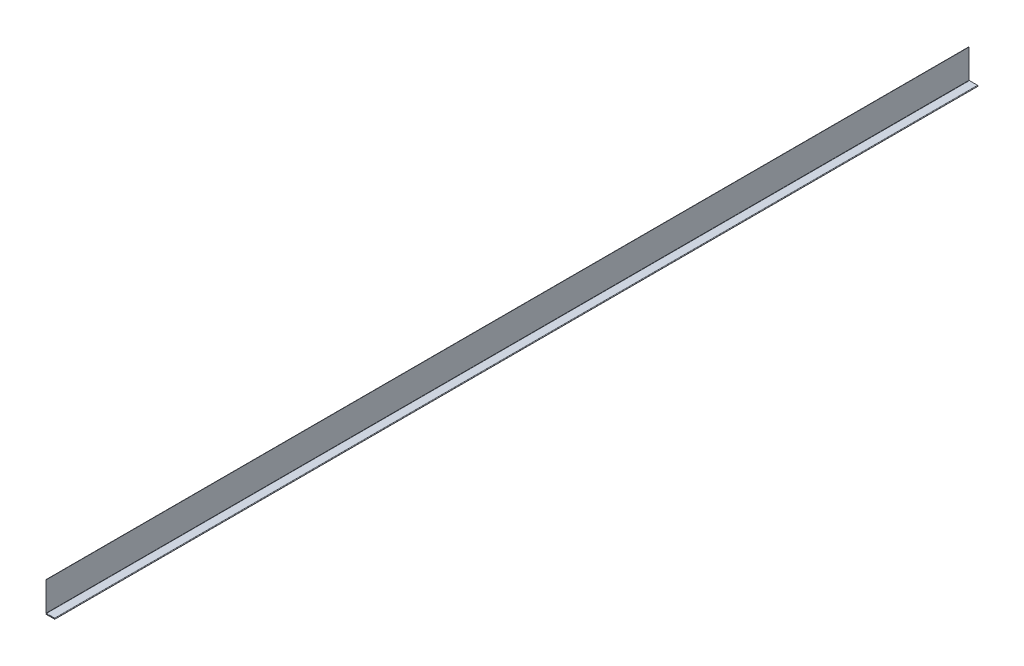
from build123d import *

# Parameters (mm, degrees)
EXTRUDE_THIN1_DEPTH = 2000


with BuildPart() as part:
    # Sketch1 → Extrude-Thin1 (new body)
    with BuildSketch(Plane.XY):
        with BuildLine():
            Line((0, -1.016), (18.542, -1.016))
            ThreePointArc((18.542, -1.016), (19.05, -0.508), (18.542, 0))
            Line((18.542, 0), (1, 0))
            ThreePointArc((1, 0), (0.292893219, 0.292893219), (0, 1))
            Line((0, 1), (0, 63.5))
            Line((0, 63.5), (0.508, 63.5))
            Line((0.508, 63.5), (0.508, 1))
            ThreePointArc((0.508, 1), (0.652103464, 0.652103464), (1, 0.508))
            Line((1, 0.508), (18.542, 0.508))
            ThreePointArc((18.542, 0.508), (19.558, -0.508), (18.542, -1.524))
            Line((18.542, -1.524), (0, -1.524))
            Line((0, -1.524), (0, -1.016))
        make_face()
    extrude(amount=EXTRUDE_THIN1_DEPTH)


solid = part.part
